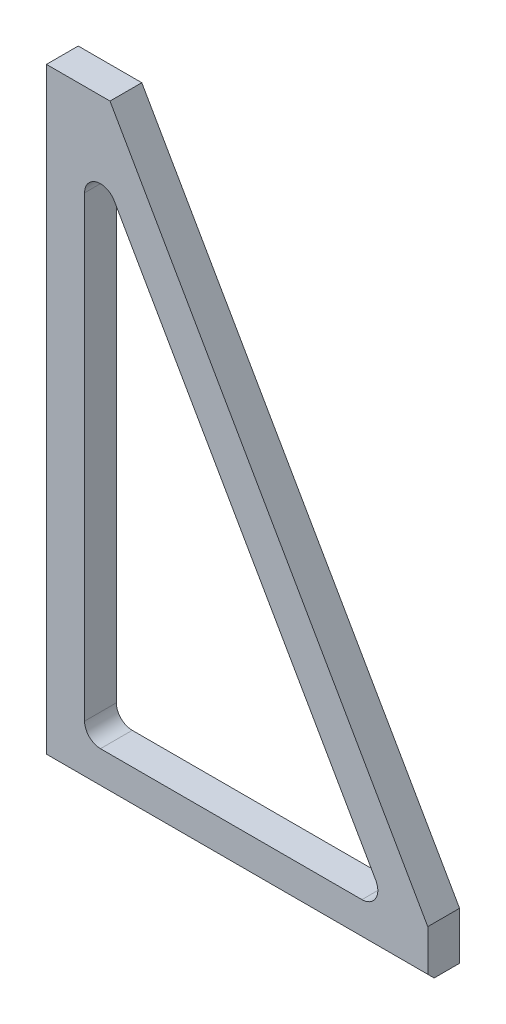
from build123d import *

# Parameters (mm, degrees)
BASE_EXTRUDE_DEPTH = 12.7
CHAMFER2_SIZE      = 2.54


with BuildPart() as part:
    # Sketch1 → Base-Extrude (new body)
    with BuildSketch(Plane.XY):
        Polygon((0, 0), (152.4, 0), (152.4, 19.05), (25.4, 241.3), (0, 241.3), align=None)
        with BuildLine():
            Line((15.24, 21.59), (15.24, 204.451463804))
            ThreePointArc((15.24, 204.451463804), (19.960158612, 210.588736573), (27.103343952, 207.601946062))
            Line((27.103343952, 207.601946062), (131.595608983, 24.740482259))
            ThreePointArc((131.595608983, 24.740482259), (131.574444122, 18.402764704), (126.082265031, 15.24))
            Line((126.082265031, 15.24), (21.59, 15.24))
            ThreePointArc((21.59, 15.24), (17.099871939, 17.099871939), (15.24, 21.59))
        make_face(mode=Mode.SUBTRACT)
    extrude(amount=BASE_EXTRUDE_DEPTH)

    # Chamfer2
    chamfer2_edges = [part.edges().sort_by_distance(p)[0] for p in [
        (76.2, 0, 12.7),
    ]]
    chamfer(chamfer2_edges, length=CHAMFER2_SIZE)


solid = part.part
